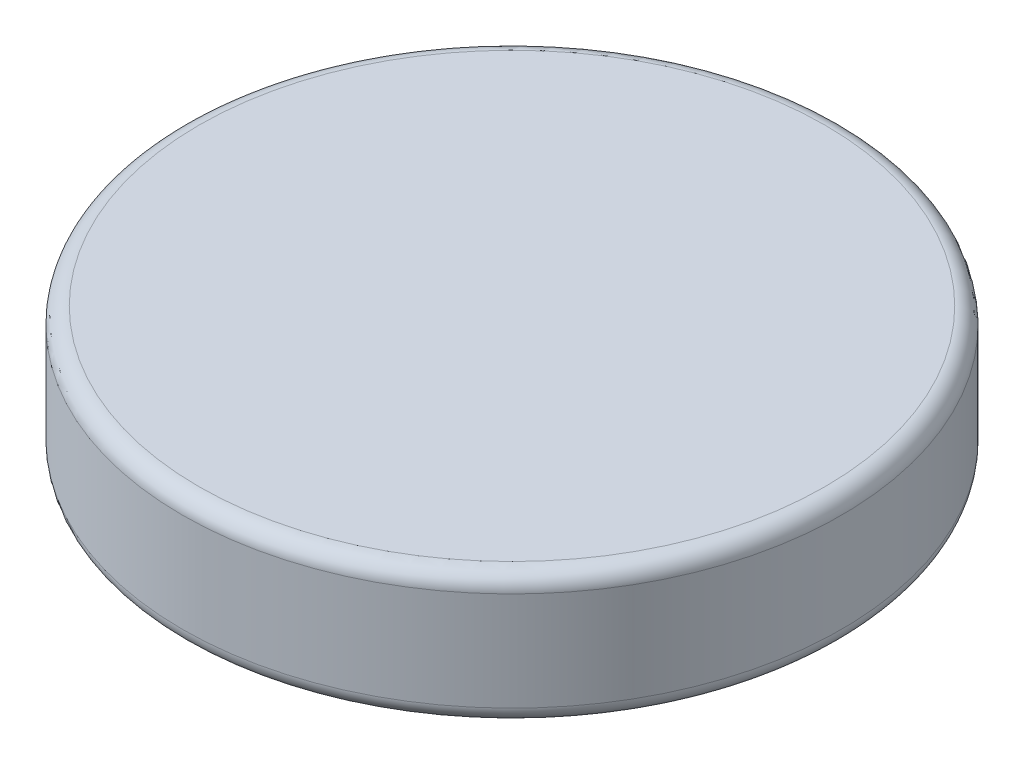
from build123d import *

# Parameters (mm, degrees)
SCHIZZO1_R                   = 10
ESTRUSIONE_ESTRUSIONE1_DEPTH = 4
RACCORDO1_R                  = 0.5
RACCORDO2_R                  = 0.5


with BuildPart() as part:
    # Schizzo1 → Estrusione-Estrusione1 (new body)
    with BuildSketch(Plane(origin=(0, 0, 0), x_dir=(1, 0, 0), z_dir=(0, 1, 0))):
        with Locations(Location((0, 0, 0), (0, 0, 270))):
            Circle(SCHIZZO1_R)
    extrude(amount=ESTRUSIONE_ESTRUSIONE1_DEPTH)

    # Raccordo1
    raccordo1_edges = [part.edges().sort_by_distance(p)[0] for p in [
        (0, 4, -10),
    ]]
    fillet(raccordo1_edges, radius=RACCORDO1_R)

    # Raccordo2
    raccordo2_edges = [part.edges().sort_by_distance(p)[0] for p in [
        (0, 0, -10),
    ]]
    fillet(raccordo2_edges, radius=RACCORDO2_R)


solid = part.part
